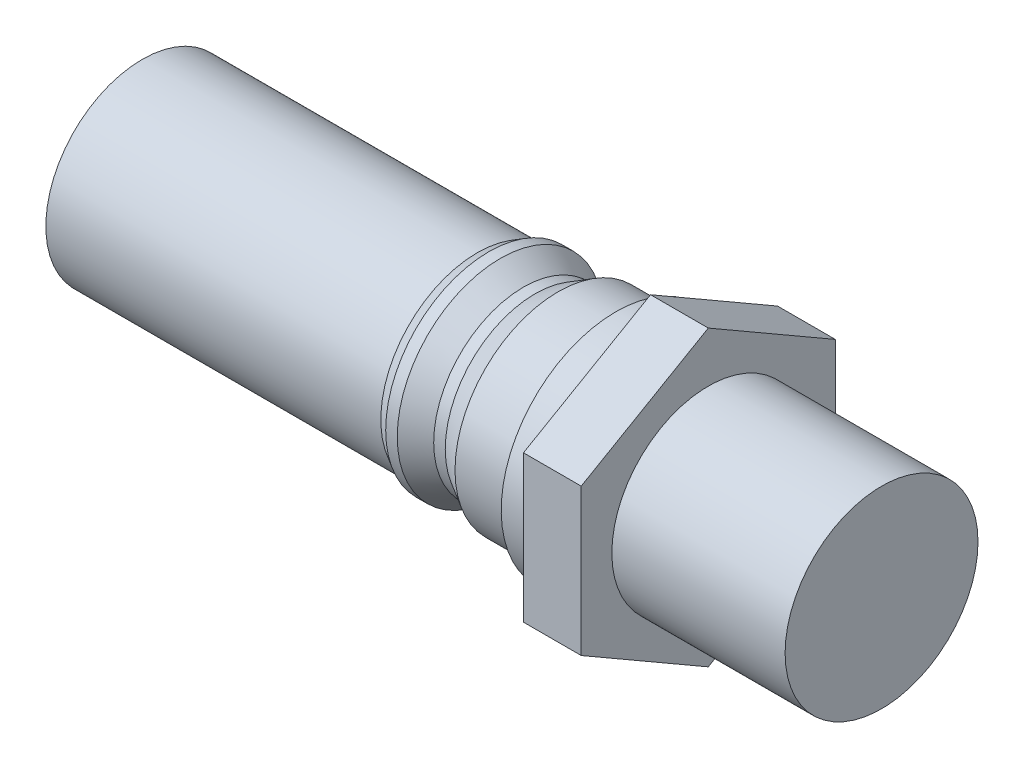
ISO-10303-21;
HEADER;
FILE_DESCRIPTION(('STEP AP214'),'2;1');
FILE_NAME('part.step','',(''),(''),'','','');
FILE_SCHEMA(('AUTOMOTIVE_DESIGN { 1 0 10303 214 1 1 1 1 }'));
ENDSEC;
DATA;
#1=APPLICATION_CONTEXT('core data for automotive mechanical design processes');
#2=APPLICATION_PROTOCOL_DEFINITION('international standard','automotive_design',2000,#1);
#3=PRODUCT_CONTEXT('',#1,'mechanical');
#4=PRODUCT('Part','Part','',(#3));
#5=PRODUCT_RELATED_PRODUCT_CATEGORY('part','',(#4));
#6=PRODUCT_DEFINITION_FORMATION('','',#4);
#7=PRODUCT_DEFINITION_CONTEXT('part definition',#1,'design');
#8=PRODUCT_DEFINITION('design','',#6,#7);
#9=PRODUCT_DEFINITION_SHAPE('','',#8);
#10=(LENGTH_UNIT() NAMED_UNIT(*) SI_UNIT(.MILLI.,.METRE.));
#11=(NAMED_UNIT(*) PLANE_ANGLE_UNIT() SI_UNIT($,.RADIAN.));
#12=(NAMED_UNIT(*) SI_UNIT($,.STERADIAN.) SOLID_ANGLE_UNIT());
#13=UNCERTAINTY_MEASURE_WITH_UNIT(LENGTH_MEASURE(1.E-05),#10,'distance_accuracy_value','');
#14=(GEOMETRIC_REPRESENTATION_CONTEXT(3) GLOBAL_UNCERTAINTY_ASSIGNED_CONTEXT((#13)) GLOBAL_UNIT_ASSIGNED_CONTEXT((#10,
#11,#12)) REPRESENTATION_CONTEXT('',''));
#15=CARTESIAN_POINT('',(0.,0.,0.));
#16=DIRECTION('',(0.,0.,1.));
#17=DIRECTION('',(1.,0.,0.));
#18=AXIS2_PLACEMENT_3D('',#15,#16,#17);
#19=CARTESIAN_POINT('',(0.,0.,0.));
#20=DIRECTION('',(-1.,0.,0.));
#21=DIRECTION('',(0.,-1.,0.));
#22=AXIS2_PLACEMENT_3D('',#19,#20,#21);
#23=PLANE('',#22);
#24=CARTESIAN_POINT('',(0.,0.,0.));
#25=DIRECTION('',(1.,0.,0.));
#26=DIRECTION('',(0.,1.,0.));
#27=AXIS2_PLACEMENT_3D('',#24,#25,#26);
#28=CIRCLE('',#27,8.35);
#29=CARTESIAN_POINT('',(0.,8.35,0.));
#30=VERTEX_POINT('',#29);
#31=EDGE_CURVE('E11',#30,#30,#28,.T.);
#32=ORIENTED_EDGE('',*,*,#31,.F.);
#33=EDGE_LOOP('',(#32));
#34=FACE_BOUND('',#33,.T.);
#35=ADVANCED_FACE('F33',(#34),#23,.T.);
#36=CARTESIAN_POINT('',(44.,0.,0.));
#37=DIRECTION('',(1.,0.,0.));
#38=DIRECTION('',(0.,1.,0.));
#39=AXIS2_PLACEMENT_3D('',#36,#37,#38);
#40=CYLINDRICAL_SURFACE('',#39,8.35);
#41=ORIENTED_EDGE('',*,*,#31,.T.);
#42=EDGE_LOOP('',(#41));
#43=FACE_BOUND('',#42,.T.);
#44=CARTESIAN_POINT('',(29.,0.,0.));
#45=DIRECTION('',(1.,0.,0.));
#46=DIRECTION('',(0.,1.,0.));
#47=AXIS2_PLACEMENT_3D('',#44,#45,#46);
#48=CIRCLE('',#47,8.35);
#49=CARTESIAN_POINT('',(29.,8.35,0.));
#50=VERTEX_POINT('',#49);
#51=EDGE_CURVE('E41',#50,#50,#48,.T.);
#52=ORIENTED_EDGE('',*,*,#51,.F.);
#53=EDGE_LOOP('',(#52));
#54=FACE_BOUND('',#53,.T.);
#55=ADVANCED_FACE('F167',(#43,#54),#40,.T.);
#56=CARTESIAN_POINT('',(30.,0.,0.));
#57=DIRECTION('',(1.,0.,0.));
#58=DIRECTION('',(0.,1.,0.));
#59=AXIS2_PLACEMENT_3D('',#56,#57,#58);
#60=CONICAL_SURFACE('',#59,8.92735026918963,0.523598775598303);
#61=ORIENTED_EDGE('',*,*,#51,.T.);
#62=EDGE_LOOP('',(#61));
#63=FACE_BOUND('',#62,.T.);
#64=CARTESIAN_POINT('',(30.,0.,0.));
#65=DIRECTION('',(1.,0.,0.));
#66=DIRECTION('',(0.,1.,0.));
#67=AXIS2_PLACEMENT_3D('',#64,#65,#66);
#68=CIRCLE('',#67,8.92735026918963);
#69=CARTESIAN_POINT('',(30.,8.92735026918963,0.));
#70=VERTEX_POINT('',#69);
#71=EDGE_CURVE('E159',#70,#70,#68,.T.);
#72=ORIENTED_EDGE('',*,*,#71,.F.);
#73=EDGE_LOOP('',(#72));
#74=FACE_BOUND('',#73,.T.);
#75=ADVANCED_FACE('F164',(#63,#74),#60,.T.);
#76=CARTESIAN_POINT('',(44.,0.,0.));
#77=DIRECTION('',(1.,0.,0.));
#78=DIRECTION('',(0.,1.,0.));
#79=AXIS2_PLACEMENT_3D('',#76,#77,#78);
#80=CYLINDRICAL_SURFACE('',#79,8.92735026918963);
#81=ORIENTED_EDGE('',*,*,#71,.T.);
#82=EDGE_LOOP('',(#81));
#83=FACE_BOUND('',#82,.T.);
#84=CARTESIAN_POINT('',(31.,0.,0.));
#85=DIRECTION('',(1.,0.,0.));
#86=DIRECTION('',(0.,1.,0.));
#87=AXIS2_PLACEMENT_3D('',#84,#85,#86);
#88=CIRCLE('',#87,8.92735026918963);
#89=CARTESIAN_POINT('',(31.,8.92735026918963,0.));
#90=VERTEX_POINT('',#89);
#91=EDGE_CURVE('E156',#90,#90,#88,.T.);
#92=ORIENTED_EDGE('',*,*,#91,.F.);
#93=EDGE_LOOP('',(#92));
#94=FACE_BOUND('',#93,.T.);
#95=ADVANCED_FACE('F174',(#83,#94),#80,.T.);
#96=CARTESIAN_POINT('',(33.,0.,0.));
#97=DIRECTION('',(-1.,0.,0.));
#98=DIRECTION('',(0.,-1.,0.));
#99=AXIS2_PLACEMENT_3D('',#96,#97,#98);
#100=CONICAL_SURFACE('',#99,7.77264973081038,0.523598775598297);
#101=ORIENTED_EDGE('',*,*,#91,.T.);
#102=EDGE_LOOP('',(#101));
#103=FACE_BOUND('',#102,.T.);
#104=CARTESIAN_POINT('',(33.,0.,0.));
#105=DIRECTION('',(1.,0.,0.));
#106=DIRECTION('',(0.,1.,0.));
#107=AXIS2_PLACEMENT_3D('',#104,#105,#106);
#108=CIRCLE('',#107,7.77264973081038);
#109=CARTESIAN_POINT('',(33.,7.77264973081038,0.));
#110=VERTEX_POINT('',#109);
#111=EDGE_CURVE('E153',#110,#110,#108,.T.);
#112=ORIENTED_EDGE('',*,*,#111,.F.);
#113=EDGE_LOOP('',(#112));
#114=FACE_BOUND('',#113,.T.);
#115=ADVANCED_FACE('F180',(#103,#114),#100,.T.);
#116=CARTESIAN_POINT('',(44.,0.,0.));
#117=DIRECTION('',(1.,0.,0.));
#118=DIRECTION('',(0.,1.,0.));
#119=AXIS2_PLACEMENT_3D('',#116,#117,#118);
#120=CYLINDRICAL_SURFACE('',#119,7.77264973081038);
#121=ORIENTED_EDGE('',*,*,#111,.T.);
#122=EDGE_LOOP('',(#121));
#123=FACE_BOUND('',#122,.T.);
#124=CARTESIAN_POINT('',(34.,0.,0.));
#125=DIRECTION('',(1.,0.,0.));
#126=DIRECTION('',(0.,1.,0.));
#127=AXIS2_PLACEMENT_3D('',#124,#125,#126);
#128=CIRCLE('',#127,7.77264973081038);
#129=CARTESIAN_POINT('',(34.,7.77264973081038,0.));
#130=VERTEX_POINT('',#129);
#131=EDGE_CURVE('E150',#130,#130,#128,.T.);
#132=ORIENTED_EDGE('',*,*,#131,.F.);
#133=EDGE_LOOP('',(#132));
#134=FACE_BOUND('',#133,.T.);
#135=ADVANCED_FACE('F184',(#123,#134),#120,.T.);
#136=CARTESIAN_POINT('',(36.,0.,0.));
#137=DIRECTION('',(1.,0.,0.));
#138=DIRECTION('',(0.,1.,0.));
#139=AXIS2_PLACEMENT_3D('',#136,#137,#138);
#140=CONICAL_SURFACE('',#139,8.92735026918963,0.523598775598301);
#141=ORIENTED_EDGE('',*,*,#131,.T.);
#142=EDGE_LOOP('',(#141));
#143=FACE_BOUND('',#142,.T.);
#144=CARTESIAN_POINT('',(36.,0.,0.));
#145=DIRECTION('',(1.,0.,0.));
#146=DIRECTION('',(0.,1.,0.));
#147=AXIS2_PLACEMENT_3D('',#144,#145,#146);
#148=CIRCLE('',#147,8.92735026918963);
#149=CARTESIAN_POINT('',(36.,8.92735026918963,0.));
#150=VERTEX_POINT('',#149);
#151=EDGE_CURVE('E147',#150,#150,#148,.T.);
#152=ORIENTED_EDGE('',*,*,#151,.F.);
#153=EDGE_LOOP('',(#152));
#154=FACE_BOUND('',#153,.T.);
#155=ADVANCED_FACE('F188',(#143,#154),#140,.T.);
#156=CARTESIAN_POINT('',(44.,0.,0.));
#157=DIRECTION('',(1.,0.,0.));
#158=DIRECTION('',(0.,1.,0.));
#159=AXIS2_PLACEMENT_3D('',#156,#157,#158);
#160=CYLINDRICAL_SURFACE('',#159,8.92735026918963);
#161=ORIENTED_EDGE('',*,*,#151,.T.);
#162=EDGE_LOOP('',(#161));
#163=FACE_BOUND('',#162,.T.);
#164=CARTESIAN_POINT('',(41.,0.,0.));
#165=DIRECTION('',(1.,0.,0.));
#166=DIRECTION('',(0.,1.,0.));
#167=AXIS2_PLACEMENT_3D('',#164,#165,#166);
#168=CIRCLE('',#167,8.92735026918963);
#169=CARTESIAN_POINT('',(41.,8.92735026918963,0.));
#170=VERTEX_POINT('',#169);
#171=EDGE_CURVE('E144',#170,#170,#168,.T.);
#172=ORIENTED_EDGE('',*,*,#171,.F.);
#173=EDGE_LOOP('',(#172));
#174=FACE_BOUND('',#173,.T.);
#175=ADVANCED_FACE('F192',(#163,#174),#160,.T.);
#176=CARTESIAN_POINT('',(41.,8.92735026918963,0.));
#177=DIRECTION('',(-1.,0.,0.));
#178=DIRECTION('',(0.,-1.,0.));
#179=AXIS2_PLACEMENT_3D('',#176,#177,#178);
#180=PLANE('',#179);
#181=ORIENTED_EDGE('',*,*,#171,.T.);
#182=EDGE_LOOP('',(#181));
#183=FACE_BOUND('',#182,.T.);
#184=CARTESIAN_POINT('',(41.,0.,0.));
#185=DIRECTION('',(1.,0.,0.));
#186=DIRECTION('',(0.,1.,0.));
#187=AXIS2_PLACEMENT_3D('',#184,#185,#186);
#188=CIRCLE('',#187,9.92735026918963);
#189=CARTESIAN_POINT('',(41.,9.92735026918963,0.));
#190=VERTEX_POINT('',#189);
#191=EDGE_CURVE('E141',#190,#190,#188,.T.);
#192=ORIENTED_EDGE('',*,*,#191,.F.);
#193=EDGE_LOOP('',(#192));
#194=FACE_BOUND('',#193,.T.);
#195=ADVANCED_FACE('F196',(#183,#194),#180,.T.);
#196=CARTESIAN_POINT('',(44.,0.,0.));
#197=DIRECTION('',(1.,0.,0.));
#198=DIRECTION('',(0.,1.,0.));
#199=AXIS2_PLACEMENT_3D('',#196,#197,#198);
#200=CYLINDRICAL_SURFACE('',#199,9.92735026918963);
#201=ORIENTED_EDGE('',*,*,#191,.T.);
#202=EDGE_LOOP('',(#201));
#203=FACE_BOUND('',#202,.T.);
#204=CARTESIAN_POINT('',(44.,0.,0.));
#205=DIRECTION('',(1.,0.,0.));
#206=DIRECTION('',(0.,1.,0.));
#207=AXIS2_PLACEMENT_3D('',#204,#205,#206);
#208=CIRCLE('',#207,9.92735026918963);
#209=CARTESIAN_POINT('',(44.,9.92735026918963,0.));
#210=VERTEX_POINT('',#209);
#211=EDGE_CURVE('E138',#210,#210,#208,.T.);
#212=ORIENTED_EDGE('',*,*,#211,.F.);
#213=EDGE_LOOP('',(#212));
#214=FACE_BOUND('',#213,.T.);
#215=ADVANCED_FACE('F200',(#203,#214),#200,.T.);
#216=CARTESIAN_POINT('',(49.,6.35085296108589,-11.));
#217=DIRECTION('',(0.,-0.866025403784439,0.5));
#218=DIRECTION('',(0.,-0.5,-0.866025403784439));
#219=AXIS2_PLACEMENT_3D('',#216,#217,#218);
#220=PLANE('',#219);
#221=DIRECTION('',(0.,0.5,0.866025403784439));
#222=VECTOR('',#221,1.);
#223=CARTESIAN_POINT('',(44.,6.35085296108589,-11.));
#224=LINE('',#223,#222);
#225=CARTESIAN_POINT('',(44.,6.35085296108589,-11.));
#226=VERTEX_POINT('',#225);
#227=CARTESIAN_POINT('',(44.,12.7017059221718,0.));
#228=VERTEX_POINT('',#227);
#229=EDGE_CURVE('E118',#226,#228,#224,.T.);
#230=ORIENTED_EDGE('',*,*,#229,.T.);
#231=DIRECTION('',(-1.,0.,0.));
#232=VECTOR('',#231,1.);
#233=CARTESIAN_POINT('',(49.,12.7017059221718,0.));
#234=LINE('',#233,#232);
#235=CARTESIAN_POINT('',(49.,12.7017059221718,0.));
#236=VERTEX_POINT('',#235);
#237=EDGE_CURVE('E136',#236,#228,#234,.T.);
#238=ORIENTED_EDGE('',*,*,#237,.F.);
#239=DIRECTION('',(0.,0.5,0.866025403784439));
#240=VECTOR('',#239,1.);
#241=CARTESIAN_POINT('',(49.,6.35085296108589,-11.));
#242=LINE('',#241,#240);
#243=CARTESIAN_POINT('',(49.,6.35085296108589,-11.));
#244=VERTEX_POINT('',#243);
#245=EDGE_CURVE('E129',#244,#236,#242,.T.);
#246=ORIENTED_EDGE('',*,*,#245,.F.);
#247=DIRECTION('',(-1.,0.,0.));
#248=VECTOR('',#247,1.);
#249=CARTESIAN_POINT('',(49.,6.35085296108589,-11.));
#250=LINE('',#249,#248);
#251=EDGE_CURVE('E114',#244,#226,#250,.T.);
#252=ORIENTED_EDGE('',*,*,#251,.T.);
#253=EDGE_LOOP('',(#230,#238,#246,#252));
#254=FACE_BOUND('',#253,.T.);
#255=ADVANCED_FACE('F204',(#254),#220,.F.);
#256=CARTESIAN_POINT('',(49.,12.7017059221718,0.));
#257=DIRECTION('',(0.,-0.866025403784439,-0.5));
#258=DIRECTION('',(0.,0.5,-0.866025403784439));
#259=AXIS2_PLACEMENT_3D('',#256,#257,#258);
#260=PLANE('',#259);
#261=DIRECTION('',(0.,-0.5,0.866025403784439));
#262=VECTOR('',#261,1.);
#263=CARTESIAN_POINT('',(44.,12.7017059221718,0.));
#264=LINE('',#263,#262);
#265=CARTESIAN_POINT('',(44.,6.35085296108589,11.));
#266=VERTEX_POINT('',#265);
#267=EDGE_CURVE('E121',#228,#266,#264,.T.);
#268=ORIENTED_EDGE('',*,*,#267,.T.);
#269=DIRECTION('',(-1.,0.,0.));
#270=VECTOR('',#269,1.);
#271=CARTESIAN_POINT('',(49.,6.35085296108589,11.));
#272=LINE('',#271,#270);
#273=CARTESIAN_POINT('',(49.,6.35085296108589,11.));
#274=VERTEX_POINT('',#273);
#275=EDGE_CURVE('E133',#274,#266,#272,.T.);
#276=ORIENTED_EDGE('',*,*,#275,.F.);
#277=DIRECTION('',(0.,-0.5,0.866025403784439));
#278=VECTOR('',#277,1.);
#279=CARTESIAN_POINT('',(49.,12.7017059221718,0.));
#280=LINE('',#279,#278);
#281=EDGE_CURVE('E87',#236,#274,#280,.T.);
#282=ORIENTED_EDGE('',*,*,#281,.F.);
#283=ORIENTED_EDGE('',*,*,#237,.T.);
#284=EDGE_LOOP('',(#268,#276,#282,#283));
#285=FACE_BOUND('',#284,.T.);
#286=ADVANCED_FACE('F208',(#285),#260,.F.);
#287=CARTESIAN_POINT('',(49.,6.35085296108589,11.));
#288=DIRECTION('',(0.,0.,-1.));
#289=DIRECTION('',(0.,1.,0.));
#290=AXIS2_PLACEMENT_3D('',#287,#288,#289);
#291=PLANE('',#290);
#292=DIRECTION('',(0.,-1.,0.));
#293=VECTOR('',#292,1.);
#294=CARTESIAN_POINT('',(44.,6.35085296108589,11.));
#295=LINE('',#294,#293);
#296=CARTESIAN_POINT('',(44.,-6.35085296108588,11.));
#297=VERTEX_POINT('',#296);
#298=EDGE_CURVE('E124',#266,#297,#295,.T.);
#299=ORIENTED_EDGE('',*,*,#298,.T.);
#300=DIRECTION('',(-1.,0.,0.));
#301=VECTOR('',#300,1.);
#302=CARTESIAN_POINT('',(49.,-6.35085296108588,11.));
#303=LINE('',#302,#301);
#304=CARTESIAN_POINT('',(49.,-6.35085296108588,11.));
#305=VERTEX_POINT('',#304);
#306=EDGE_CURVE('E109',#305,#297,#303,.T.);
#307=ORIENTED_EDGE('',*,*,#306,.F.);
#308=DIRECTION('',(0.,-1.,0.));
#309=VECTOR('',#308,1.);
#310=CARTESIAN_POINT('',(49.,6.35085296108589,11.));
#311=LINE('',#310,#309);
#312=EDGE_CURVE('E100',#274,#305,#311,.T.);
#313=ORIENTED_EDGE('',*,*,#312,.F.);
#314=ORIENTED_EDGE('',*,*,#275,.T.);
#315=EDGE_LOOP('',(#299,#307,#313,#314));
#316=FACE_BOUND('',#315,.T.);
#317=ADVANCED_FACE('F212',(#316),#291,.F.);
#318=CARTESIAN_POINT('',(49.,-6.35085296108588,11.));
#319=DIRECTION('',(0.,0.866025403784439,-0.5));
#320=DIRECTION('',(0.,0.5,0.866025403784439));
#321=AXIS2_PLACEMENT_3D('',#318,#319,#320);
#322=PLANE('',#321);
#323=DIRECTION('',(0.,-0.5,-0.866025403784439));
#324=VECTOR('',#323,1.);
#325=CARTESIAN_POINT('',(44.,-6.35085296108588,11.));
#326=LINE('',#325,#324);
#327=CARTESIAN_POINT('',(44.,-12.7017059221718,0.));
#328=VERTEX_POINT('',#327);
#329=EDGE_CURVE('E108',#297,#328,#326,.T.);
#330=ORIENTED_EDGE('',*,*,#329,.T.);
#331=DIRECTION('',(-1.,0.,0.));
#332=VECTOR('',#331,1.);
#333=CARTESIAN_POINT('',(49.,-12.7017059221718,0.));
#334=LINE('',#333,#332);
#335=CARTESIAN_POINT('',(49.,-12.7017059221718,0.));
#336=VERTEX_POINT('',#335);
#337=EDGE_CURVE('E105',#336,#328,#334,.T.);
#338=ORIENTED_EDGE('',*,*,#337,.F.);
#339=DIRECTION('',(0.,-0.5,-0.866025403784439));
#340=VECTOR('',#339,1.);
#341=CARTESIAN_POINT('',(49.,-6.35085296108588,11.));
#342=LINE('',#341,#340);
#343=EDGE_CURVE('E94',#305,#336,#342,.T.);
#344=ORIENTED_EDGE('',*,*,#343,.F.);
#345=ORIENTED_EDGE('',*,*,#306,.T.);
#346=EDGE_LOOP('',(#330,#338,#344,#345));
#347=FACE_BOUND('',#346,.T.);
#348=ADVANCED_FACE('F106',(#347),#322,.F.);
#349=CARTESIAN_POINT('',(49.,-12.7017059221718,0.));
#350=DIRECTION('',(0.,0.866025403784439,0.5));
#351=DIRECTION('',(0.,-0.5,0.866025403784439));
#352=AXIS2_PLACEMENT_3D('',#349,#350,#351);
#353=PLANE('',#352);
#354=DIRECTION('',(0.,0.5,-0.866025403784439));
#355=VECTOR('',#354,1.);
#356=CARTESIAN_POINT('',(44.,-12.7017059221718,0.));
#357=LINE('',#356,#355);
#358=CARTESIAN_POINT('',(44.,-6.35085296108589,-11.));
#359=VERTEX_POINT('',#358);
#360=EDGE_CURVE('E72',#328,#359,#357,.T.);
#361=ORIENTED_EDGE('',*,*,#360,.T.);
#362=DIRECTION('',(-1.,0.,0.));
#363=VECTOR('',#362,1.);
#364=CARTESIAN_POINT('',(49.,-6.35085296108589,-11.));
#365=LINE('',#364,#363);
#366=CARTESIAN_POINT('',(49.,-6.35085296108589,-11.));
#367=VERTEX_POINT('',#366);
#368=EDGE_CURVE('E110',#367,#359,#365,.T.);
#369=ORIENTED_EDGE('',*,*,#368,.F.);
#370=DIRECTION('',(0.,0.5,-0.866025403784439));
#371=VECTOR('',#370,1.);
#372=CARTESIAN_POINT('',(49.,-12.7017059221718,0.));
#373=LINE('',#372,#371);
#374=EDGE_CURVE('E98',#336,#367,#373,.T.);
#375=ORIENTED_EDGE('',*,*,#374,.F.);
#376=ORIENTED_EDGE('',*,*,#337,.T.);
#377=EDGE_LOOP('',(#361,#369,#375,#376));
#378=FACE_BOUND('',#377,.T.);
#379=ADVANCED_FACE('F112',(#378),#353,.F.);
#380=CARTESIAN_POINT('',(49.,-6.35085296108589,-11.));
#381=DIRECTION('',(0.,0.,1.));
#382=DIRECTION('',(0.,-1.,0.));
#383=AXIS2_PLACEMENT_3D('',#380,#381,#382);
#384=PLANE('',#383);
#385=DIRECTION('',(0.,1.,0.));
#386=VECTOR('',#385,1.);
#387=CARTESIAN_POINT('',(44.,-6.35085296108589,-11.));
#388=LINE('',#387,#386);
#389=EDGE_CURVE('E78',#359,#226,#388,.T.);
#390=ORIENTED_EDGE('',*,*,#389,.T.);
#391=ORIENTED_EDGE('',*,*,#251,.F.);
#392=DIRECTION('',(0.,1.,0.));
#393=VECTOR('',#392,1.);
#394=CARTESIAN_POINT('',(49.,-6.35085296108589,-11.));
#395=LINE('',#394,#393);
#396=EDGE_CURVE('E49',#367,#244,#395,.T.);
#397=ORIENTED_EDGE('',*,*,#396,.F.);
#398=ORIENTED_EDGE('',*,*,#368,.T.);
#399=EDGE_LOOP('',(#390,#391,#397,#398));
#400=FACE_BOUND('',#399,.T.);
#401=ADVANCED_FACE('F220',(#400),#384,.F.);
#402=CARTESIAN_POINT('',(49.,0.,0.));
#403=DIRECTION('',(1.,0.,0.));
#404=DIRECTION('',(0.,0.,-1.));
#405=AXIS2_PLACEMENT_3D('',#402,#403,#404);
#406=PLANE('',#405);
#407=CARTESIAN_POINT('',(49.,0.,0.));
#408=DIRECTION('',(-1.,0.,0.));
#409=DIRECTION('',(0.,0.,1.));
#410=AXIS2_PLACEMENT_3D('',#407,#408,#409);
#411=CIRCLE('',#410,8.35);
#412=CARTESIAN_POINT('',(49.,0.,8.35));
#413=VERTEX_POINT('',#412);
#414=EDGE_CURVE('E122',#413,#413,#411,.T.);
#415=ORIENTED_EDGE('',*,*,#414,.T.);
#416=EDGE_LOOP('',(#415));
#417=FACE_BOUND('',#416,.T.);
#418=ORIENTED_EDGE('',*,*,#245,.T.);
#419=ORIENTED_EDGE('',*,*,#281,.T.);
#420=ORIENTED_EDGE('',*,*,#312,.T.);
#421=ORIENTED_EDGE('',*,*,#343,.T.);
#422=ORIENTED_EDGE('',*,*,#374,.T.);
#423=ORIENTED_EDGE('',*,*,#396,.T.);
#424=EDGE_LOOP('',(#418,#419,#420,#421,#422,#423));
#425=FACE_BOUND('',#424,.T.);
#426=ADVANCED_FACE('F96',(#417,#425),#406,.T.);
#427=CARTESIAN_POINT('',(44.,0.,0.));
#428=DIRECTION('',(1.,0.,0.));
#429=DIRECTION('',(0.,0.,-1.));
#430=AXIS2_PLACEMENT_3D('',#427,#428,#429);
#431=PLANE('',#430);
#432=ORIENTED_EDGE('',*,*,#211,.T.);
#433=EDGE_LOOP('',(#432));
#434=FACE_BOUND('',#433,.T.);
#435=ORIENTED_EDGE('',*,*,#229,.F.);
#436=ORIENTED_EDGE('',*,*,#389,.F.);
#437=ORIENTED_EDGE('',*,*,#360,.F.);
#438=ORIENTED_EDGE('',*,*,#329,.F.);
#439=ORIENTED_EDGE('',*,*,#298,.F.);
#440=ORIENTED_EDGE('',*,*,#267,.F.);
#441=EDGE_LOOP('',(#435,#436,#437,#438,#439,#440));
#442=FACE_BOUND('',#441,.T.);
#443=ADVANCED_FACE('F223',(#434,#442),#431,.F.);
#444=CARTESIAN_POINT('',(49.,0.,0.));
#445=DIRECTION('',(-1.,0.,0.));
#446=DIRECTION('',(0.,0.,1.));
#447=AXIS2_PLACEMENT_3D('',#444,#445,#446);
#448=CYLINDRICAL_SURFACE('',#447,8.35);
#449=ORIENTED_EDGE('',*,*,#414,.F.);
#450=EDGE_LOOP('',(#449));
#451=FACE_BOUND('',#450,.T.);
#452=CARTESIAN_POINT('',(64.,0.,0.));
#453=DIRECTION('',(-1.,0.,0.));
#454=DIRECTION('',(0.,0.,1.));
#455=AXIS2_PLACEMENT_3D('',#452,#453,#454);
#456=CIRCLE('',#455,8.35);
#457=CARTESIAN_POINT('',(64.,0.,8.35));
#458=VERTEX_POINT('',#457);
#459=EDGE_CURVE('E241',#458,#458,#456,.T.);
#460=ORIENTED_EDGE('',*,*,#459,.T.);
#461=EDGE_LOOP('',(#460));
#462=FACE_BOUND('',#461,.T.);
#463=ADVANCED_FACE('F226',(#451,#462),#448,.T.);
#464=CARTESIAN_POINT('',(64.,8.35,0.));
#465=DIRECTION('',(-1.,0.,0.));
#466=DIRECTION('',(0.,0.,1.));
#467=AXIS2_PLACEMENT_3D('',#464,#465,#466);
#468=PLANE('',#467);
#469=ORIENTED_EDGE('',*,*,#459,.F.);
#470=EDGE_LOOP('',(#469));
#471=FACE_BOUND('',#470,.T.);
#472=ADVANCED_FACE('F233',(#471),#468,.F.);
#473=CLOSED_SHELL('',(#35,#55,#75,#95,#115,#135,#155,#175,#195,#215,#255,#286,#317,#348,#379,
#401,#426,#443,#463,#472));
#474=MANIFOLD_SOLID_BREP('B2',#473);
#475=ADVANCED_BREP_SHAPE_REPRESENTATION('',(#18,#474),#14);
#476=SHAPE_DEFINITION_REPRESENTATION(#9,#475);
ENDSEC;
END-ISO-10303-21;
